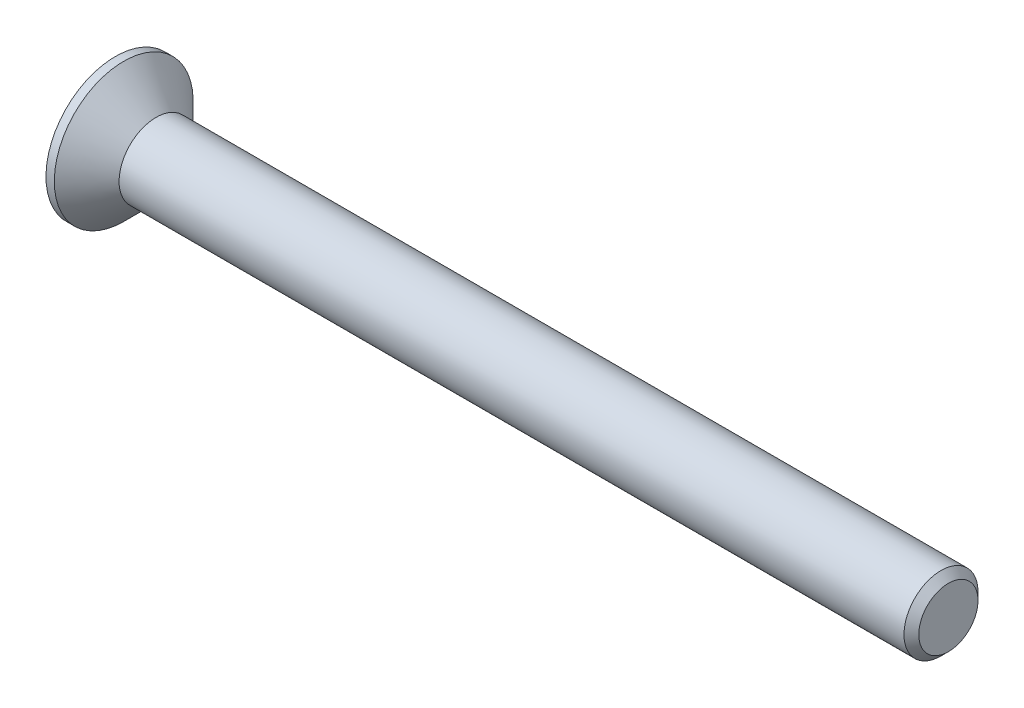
from build123d import *

# Parameters (mm, degrees)
CHAMFER1_SIZE      = 0.4
CUT_EXTRUDE1_DEPTH = 1.9


with BuildPart() as part:
    # Sketch1 → Revolve1 (revolve)
    with BuildSketch(Plane.XY, mode=Mode.PRIVATE) as revolve1_sk:
        Polygon((-2.2, 3.75), (-2.2, 0), (42.8, 0), (42.8, 2), (0, 2), (-1.75, 3.75), align=None)
    revolve(revolve1_sk.sketch.rotate(Axis((-2.2, 0, 0), (1, 0, 0)), 180), axis=Axis((-2.2, 0, 0), (1, 0, 0)))

    # Chamfer1
    chamfer1_edges = [part.edges().sort_by_distance(p)[0] for p in [
        (42.8, 2, 0),
    ]]
    chamfer(chamfer1_edges, length=CHAMFER1_SIZE)

    # Sketch2 → Cut-Extrude1 (cut)
    with BuildSketch(Plane.ZY.offset(2.2)):
        Polygon((-0.55, 2.2), (0.55, 2.2), (0.55, 0.55), (2.2, 0.55), (2.2, -0.55), (0.55, -0.55), (0.55, -2.2), (-0.55, -2.2), (-0.55, -0.55), (-2.2, -0.55), (-2.2, 0.55), (-0.55, 0.55), align=None)
    extrude(amount=-CUT_EXTRUDE1_DEPTH, mode=Mode.SUBTRACT)


solid = part.part
